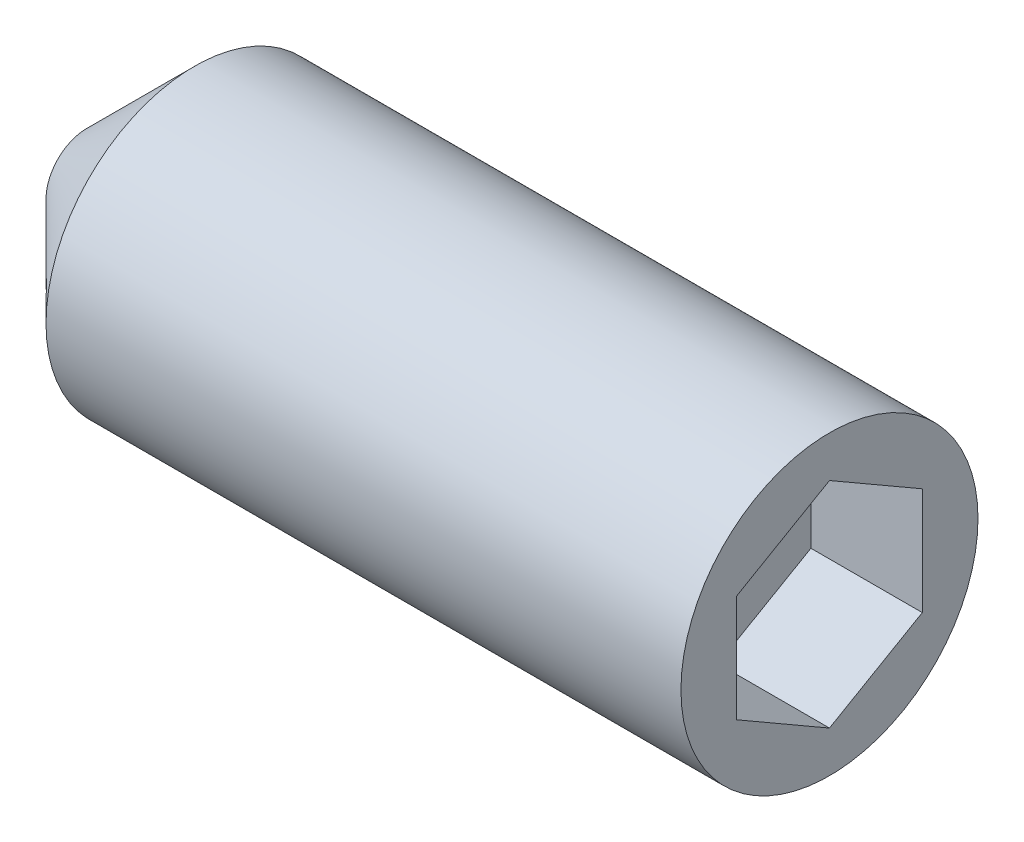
from build123d import *

# Parameters (mm, degrees)
SCHNITT_LINEAR_AUSTRAGEN1_DEPTH = 3


with BuildPart() as part:
    # Skizze1 → Rotation1 (revolve)
    with BuildSketch(Plane.XY, mode=Mode.PRIVATE) as rotation1_sk:
        Polygon((0, 0), (0, 1.1), (2.9, 4), (20, 4), (20, 0), align=None)
    revolve(rotation1_sk.sketch.rotate(Axis((20, 0, 0), (-1, 0, 0)), 90), axis=Axis((20, 0, 0), (-1, 0, 0)))

    # Skizze2 → Schnitt-Linear austragen1 (cut)
    with BuildSketch(Plane(origin=(20, 0, 0), x_dir=(0, 0, -1), z_dir=(1, 0, 0))):
        Polygon((-2.5, -1.443375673), (0, -2.886751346), (2.5, -1.443375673), (2.5, 1.443375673), (0, 2.886751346), (-2.5, 1.443375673), align=None)
    extrude(amount=-SCHNITT_LINEAR_AUSTRAGEN1_DEPTH, mode=Mode.SUBTRACT)


solid = part.part
